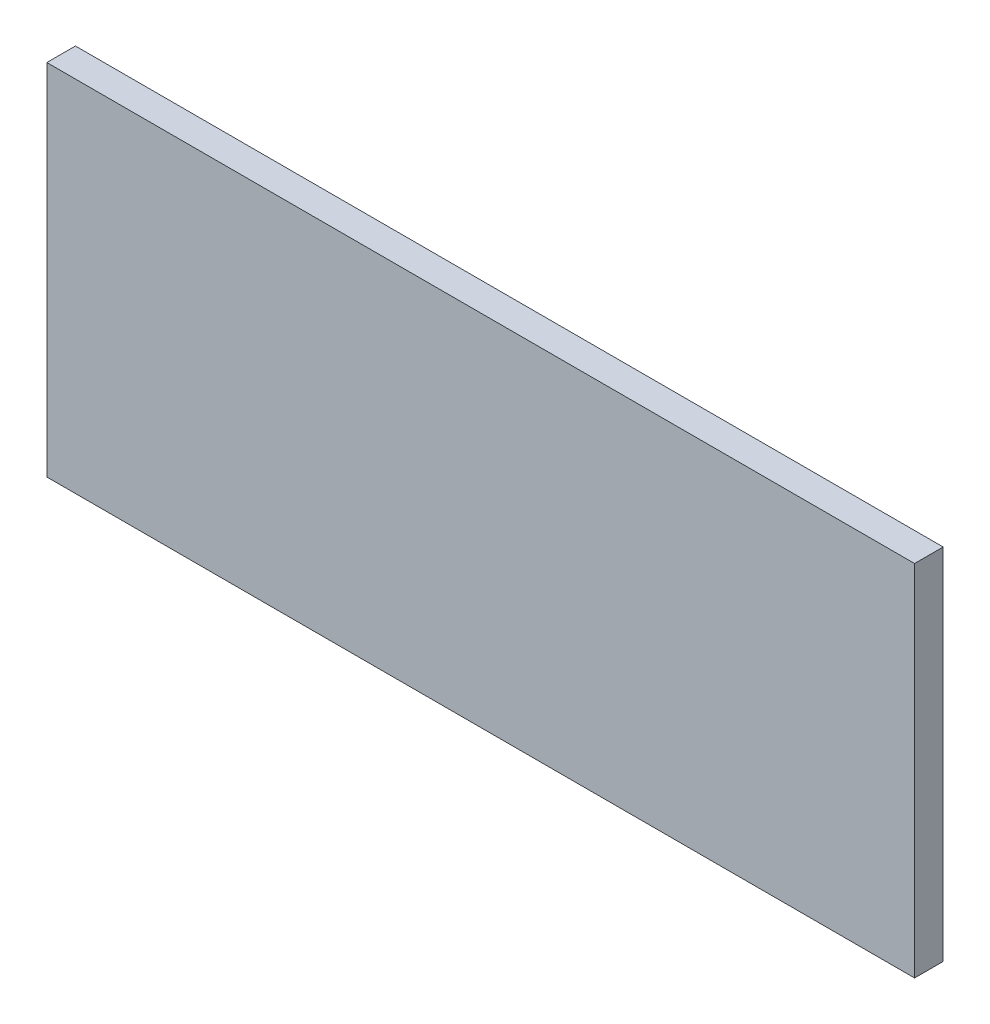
ISO-10303-21;
HEADER;
FILE_DESCRIPTION(('STEP AP214'),'2;1');
FILE_NAME('part.step','',(''),(''),'','','');
FILE_SCHEMA(('AUTOMOTIVE_DESIGN { 1 0 10303 214 1 1 1 1 }'));
ENDSEC;
DATA;
#1=APPLICATION_CONTEXT('core data for automotive mechanical design processes');
#2=APPLICATION_PROTOCOL_DEFINITION('international standard','automotive_design',2000,#1);
#3=PRODUCT_CONTEXT('',#1,'mechanical');
#4=PRODUCT('Part','Part','',(#3));
#5=PRODUCT_RELATED_PRODUCT_CATEGORY('part','',(#4));
#6=PRODUCT_DEFINITION_FORMATION('','',#4);
#7=PRODUCT_DEFINITION_CONTEXT('part definition',#1,'design');
#8=PRODUCT_DEFINITION('design','',#6,#7);
#9=PRODUCT_DEFINITION_SHAPE('','',#8);
#10=(LENGTH_UNIT() NAMED_UNIT(*) SI_UNIT(.MILLI.,.METRE.));
#11=(NAMED_UNIT(*) PLANE_ANGLE_UNIT() SI_UNIT($,.RADIAN.));
#12=(NAMED_UNIT(*) SI_UNIT($,.STERADIAN.) SOLID_ANGLE_UNIT());
#13=UNCERTAINTY_MEASURE_WITH_UNIT(LENGTH_MEASURE(1.E-05),#10,'distance_accuracy_value','');
#14=(GEOMETRIC_REPRESENTATION_CONTEXT(3) GLOBAL_UNCERTAINTY_ASSIGNED_CONTEXT((#13)) GLOBAL_UNIT_ASSIGNED_CONTEXT((#10,
#11,#12)) REPRESENTATION_CONTEXT('',''));
#15=CARTESIAN_POINT('',(0.,0.,0.));
#16=DIRECTION('',(0.,0.,1.));
#17=DIRECTION('',(1.,0.,0.));
#18=AXIS2_PLACEMENT_3D('',#15,#16,#17);
#19=CARTESIAN_POINT('',(0.,0.,38.0999999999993));
#20=DIRECTION('',(0.,0.,-1.));
#21=DIRECTION('',(-1.,0.,0.));
#22=AXIS2_PLACEMENT_3D('',#19,#20,#21);
#23=PLANE('',#22);
#24=DIRECTION('',(-1.,0.,0.));
#25=VECTOR('',#24,1.);
#26=CARTESIAN_POINT('',(-406.400000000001,-2538.87734318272,38.1000000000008));
#27=LINE('',#26,#25);
#28=CARTESIAN_POINT('',(749.299999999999,-2538.87734318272,38.0999999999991));
#29=VERTEX_POINT('',#28);
#30=CARTESIAN_POINT('',(-406.400000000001,-2538.87734318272,38.1000000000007));
#31=VERTEX_POINT('',#30);
#32=EDGE_CURVE('E73',#29,#31,#27,.T.);
#33=ORIENTED_EDGE('',*,*,#32,.F.);
#34=DIRECTION('',(0.,-1.,0.));
#35=VECTOR('',#34,1.);
#36=CARTESIAN_POINT('',(749.3,-2538.87734318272,38.0999999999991));
#37=LINE('',#36,#35);
#38=CARTESIAN_POINT('',(749.299999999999,-2060.78827278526,38.0999999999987));
#39=VERTEX_POINT('',#38);
#40=EDGE_CURVE('E80',#39,#29,#37,.T.);
#41=ORIENTED_EDGE('',*,*,#40,.F.);
#42=DIRECTION('',(1.,0.,0.));
#43=VECTOR('',#42,1.);
#44=CARTESIAN_POINT('',(-406.400000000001,-2060.78827278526,38.1));
#45=LINE('',#44,#43);
#46=CARTESIAN_POINT('',(-406.400000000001,-2060.78827278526,38.1));
#47=VERTEX_POINT('',#46);
#48=EDGE_CURVE('E103',#47,#39,#45,.T.);
#49=ORIENTED_EDGE('',*,*,#48,.F.);
#50=DIRECTION('',(0.,1.,0.));
#51=VECTOR('',#50,1.);
#52=CARTESIAN_POINT('',(-406.400000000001,-2538.87734318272,38.1000000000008));
#53=LINE('',#52,#51);
#54=EDGE_CURVE('E42',#31,#47,#53,.T.);
#55=ORIENTED_EDGE('',*,*,#54,.F.);
#56=EDGE_LOOP('',(#33,#41,#49,#55));
#57=FACE_BOUND('',#56,.T.);
#58=ADVANCED_FACE('F33',(#57),#23,.F.);
#59=CARTESIAN_POINT('',(0.,0.,-6.97479815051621E-13));
#60=DIRECTION('',(0.,0.,-1.));
#61=DIRECTION('',(-1.,0.,0.));
#62=AXIS2_PLACEMENT_3D('',#59,#60,#61);
#63=PLANE('',#62);
#64=DIRECTION('',(-1.,0.,0.));
#65=VECTOR('',#64,1.);
#66=CARTESIAN_POINT('',(-406.400000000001,-2538.87734318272,7.47384452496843E-13));
#67=LINE('',#66,#65);
#68=CARTESIAN_POINT('',(749.299999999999,-2538.87734318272,-9.24291688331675E-13));
#69=VERTEX_POINT('',#68);
#70=CARTESIAN_POINT('',(-406.400000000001,-2538.87734318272,7.47384452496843E-13));
#71=VERTEX_POINT('',#70);
#72=EDGE_CURVE('E91',#69,#71,#67,.T.);
#73=ORIENTED_EDGE('',*,*,#72,.T.);
#74=DIRECTION('',(0.,1.,0.));
#75=VECTOR('',#74,1.);
#76=CARTESIAN_POINT('',(-406.400000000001,-2538.87734318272,7.47384452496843E-13));
#77=LINE('',#76,#75);
#78=CARTESIAN_POINT('',(-406.400000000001,-2060.78827278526,0.));
#79=VERTEX_POINT('',#78);
#80=EDGE_CURVE('E12',#71,#79,#77,.T.);
#81=ORIENTED_EDGE('',*,*,#80,.T.);
#82=DIRECTION('',(1.,0.,0.));
#83=VECTOR('',#82,1.);
#84=CARTESIAN_POINT('',(-406.400000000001,-2060.78827278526,0.));
#85=LINE('',#84,#83);
#86=CARTESIAN_POINT('',(749.299999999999,-2060.78827278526,-1.3082614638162E-12));
#87=VERTEX_POINT('',#86);
#88=EDGE_CURVE('E51',#79,#87,#85,.T.);
#89=ORIENTED_EDGE('',*,*,#88,.T.);
#90=DIRECTION('',(0.,-1.,0.));
#91=VECTOR('',#90,1.);
#92=CARTESIAN_POINT('',(749.3,-2538.87734318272,-9.24291688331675E-13));
#93=LINE('',#92,#91);
#94=EDGE_CURVE('E106',#87,#69,#93,.T.);
#95=ORIENTED_EDGE('',*,*,#94,.T.);
#96=EDGE_LOOP('',(#73,#81,#89,#95));
#97=FACE_BOUND('',#96,.T.);
#98=ADVANCED_FACE('F117',(#97),#63,.T.);
#99=CARTESIAN_POINT('',(-406.400000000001,-2538.87734318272,7.47384452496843E-13));
#100=DIRECTION('',(0.,1.,0.));
#101=DIRECTION('',(0.,0.,1.));
#102=AXIS2_PLACEMENT_3D('',#99,#100,#101);
#103=PLANE('',#102);
#104=ORIENTED_EDGE('',*,*,#32,.T.);
#105=DIRECTION('',(0.,0.,1.));
#106=VECTOR('',#105,1.);
#107=CARTESIAN_POINT('',(-406.400000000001,-2538.87734318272,7.47384452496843E-13));
#108=LINE('',#107,#106);
#109=EDGE_CURVE('E87',#71,#31,#108,.T.);
#110=ORIENTED_EDGE('',*,*,#109,.F.);
#111=ORIENTED_EDGE('',*,*,#72,.F.);
#112=DIRECTION('',(0.,0.,1.));
#113=VECTOR('',#112,1.);
#114=CARTESIAN_POINT('',(749.3,-2538.87734318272,-9.24291688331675E-13));
#115=LINE('',#114,#113);
#116=EDGE_CURVE('E82',#69,#29,#115,.T.);
#117=ORIENTED_EDGE('',*,*,#116,.T.);
#118=EDGE_LOOP('',(#104,#110,#111,#117));
#119=FACE_BOUND('',#118,.T.);
#120=ADVANCED_FACE('F89',(#119),#103,.F.);
#121=CARTESIAN_POINT('',(749.3,-2538.87734318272,-9.24291688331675E-13));
#122=DIRECTION('',(-1.,0.,0.));
#123=DIRECTION('',(0.,-1.,0.));
#124=AXIS2_PLACEMENT_3D('',#121,#122,#123);
#125=PLANE('',#124);
#126=ORIENTED_EDGE('',*,*,#40,.T.);
#127=ORIENTED_EDGE('',*,*,#116,.F.);
#128=ORIENTED_EDGE('',*,*,#94,.F.);
#129=DIRECTION('',(0.,0.,1.));
#130=VECTOR('',#129,1.);
#131=CARTESIAN_POINT('',(749.299999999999,-2060.78827278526,-1.3082614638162E-12));
#132=LINE('',#131,#130);
#133=EDGE_CURVE('E84',#87,#39,#132,.T.);
#134=ORIENTED_EDGE('',*,*,#133,.T.);
#135=EDGE_LOOP('',(#126,#127,#128,#134));
#136=FACE_BOUND('',#135,.T.);
#137=ADVANCED_FACE('F81',(#136),#125,.F.);
#138=CARTESIAN_POINT('',(-406.400000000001,-2060.78827278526,0.));
#139=DIRECTION('',(0.,-1.,0.));
#140=DIRECTION('',(1.,0.,0.));
#141=AXIS2_PLACEMENT_3D('',#138,#139,#140);
#142=PLANE('',#141);
#143=ORIENTED_EDGE('',*,*,#48,.T.);
#144=ORIENTED_EDGE('',*,*,#133,.F.);
#145=ORIENTED_EDGE('',*,*,#88,.F.);
#146=DIRECTION('',(0.,0.,1.));
#147=VECTOR('',#146,1.);
#148=CARTESIAN_POINT('',(-406.400000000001,-2060.78827278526,0.));
#149=LINE('',#148,#147);
#150=EDGE_CURVE('E105',#79,#47,#149,.T.);
#151=ORIENTED_EDGE('',*,*,#150,.T.);
#152=EDGE_LOOP('',(#143,#144,#145,#151));
#153=FACE_BOUND('',#152,.T.);
#154=ADVANCED_FACE('F118',(#153),#142,.F.);
#155=CARTESIAN_POINT('',(-406.400000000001,-2538.87734318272,7.47384452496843E-13));
#156=DIRECTION('',(1.,0.,0.));
#157=DIRECTION('',(0.,1.,0.));
#158=AXIS2_PLACEMENT_3D('',#155,#156,#157);
#159=PLANE('',#158);
#160=ORIENTED_EDGE('',*,*,#54,.T.);
#161=ORIENTED_EDGE('',*,*,#150,.F.);
#162=ORIENTED_EDGE('',*,*,#80,.F.);
#163=ORIENTED_EDGE('',*,*,#109,.T.);
#164=EDGE_LOOP('',(#160,#161,#162,#163));
#165=FACE_BOUND('',#164,.T.);
#166=ADVANCED_FACE('F131',(#165),#159,.F.);
#167=CLOSED_SHELL('',(#58,#98,#120,#137,#154,#166));
#168=MANIFOLD_SOLID_BREP('B2',#167);
#169=ADVANCED_BREP_SHAPE_REPRESENTATION('',(#18,#168),#14);
#170=SHAPE_DEFINITION_REPRESENTATION(#9,#169);
ENDSEC;
END-ISO-10303-21;
